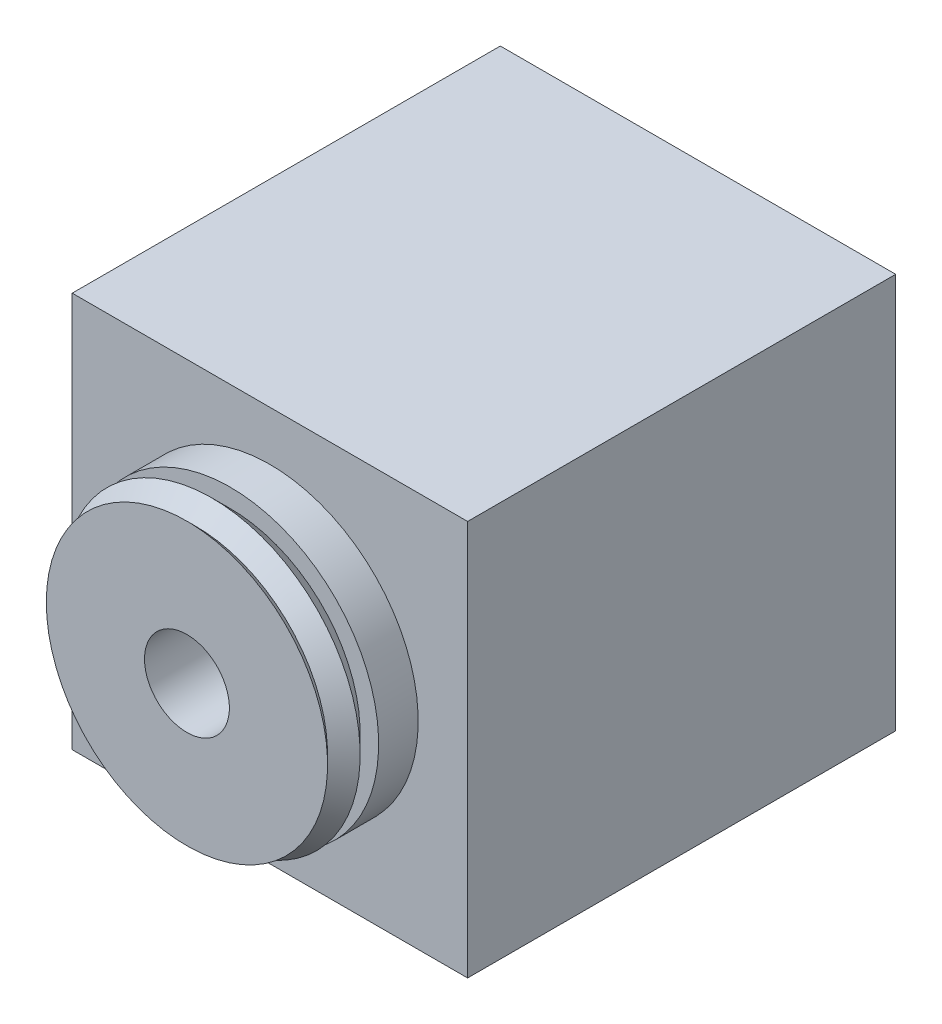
from build123d import *

# Parameters (mm, degrees)
SKETCH9_W                = 19.05
SKETCH9_H                = 19.05
F_BODY_DEPTH             = 20.6248
SKETCH11_R               = 1.7272
F_MOUNTING_HOLES_DEPTH   = 7.9248
SKETCH14_R               = 1.7272
FSR_MOUNTING_HOLES_DEPTH = 4.7498
SKETCH10_R               = 5.55625
F_BODY_2_DEPTH           = 1.5748
SKETCH3_R                = 2.0447
HOLE_CUT_DEPTH           = 30.458049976


with BuildPart() as part:
    # Sketch1 → Base (revolve)
    with BuildSketch(Plane(origin=(0, 0, 0), x_dir=(0, 0, -1), z_dir=(1, 0, 0)), mode=Mode.PRIVATE) as base_sk:
        Polygon((0, 0), (0, 6.77545), (0.41656, 6.35889), (1.20142, 7.14375), (2.093214, 6.251956), (2.093214, 7.14375), (3.998214, 7.14375), (3.998214, 0), align=None)
    revolve(base_sk.sketch.rotate(Axis((0, 0, -71.294124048), (0, 0, 1)), 90), axis=Axis((0, 0, -71.294124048), (0, 0, 1)))

    # Sketch9 → F Body (add)
    with BuildSketch(Plane(origin=(0, 0, -3.998214), x_dir=(-1, 0, 0), z_dir=(0, 0, -1))):
        Rectangle(SKETCH9_W, SKETCH9_H)
    extrude(amount=F_BODY_DEPTH)

    # Sketch11 → F Mounting Holes (cut)
    with BuildSketch(Plane(origin=(0, 0, -24.623014), x_dir=(-1, 0, 0), z_dir=(0, 0, -1))):
        with Locations((6.919507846, 6.550876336)):
            Circle(SKETCH11_R)
        with Locations(Location((-6.550876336, -6.919507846, 0), (0, 0, 180))):
            Circle(SKETCH11_R)
    extrude(amount=-F_MOUNTING_HOLES_DEPTH, mode=Mode.SUBTRACT)

    # Sketch14 → FSR Mounting Holes (cut)
    with BuildSketch(Plane.ZY.offset(9.525)):
        with Locations(Location((-7.173214, 5.5499, 0), (0, 0, 270))):
            Circle(SKETCH14_R)
        with Locations(Location((-18.273014, -5.5499, 0), (0, 0, 270))):
            Circle(SKETCH14_R)
    extrude(amount=-FSR_MOUNTING_HOLES_DEPTH, mode=Mode.SUBTRACT)

    # Sketch10 → F Body 2 (add)
    with BuildSketch(Plane(origin=(0, 0, -24.623014), x_dir=(-1, 0, 0), z_dir=(0, 0, -1))):
        Circle(SKETCH10_R)
    extrude(amount=F_BODY_2_DEPTH)

    # Sketch3 → Hole Cut (cut, through all)
    with BuildSketch(Plane(origin=(0, 0, 0), x_dir=(-1, 0, 0), z_dir=(0, 0, -1))):
        Circle(SKETCH3_R)
    extrude(amount=HOLE_CUT_DEPTH, mode=Mode.SUBTRACT)


solid = part.part
